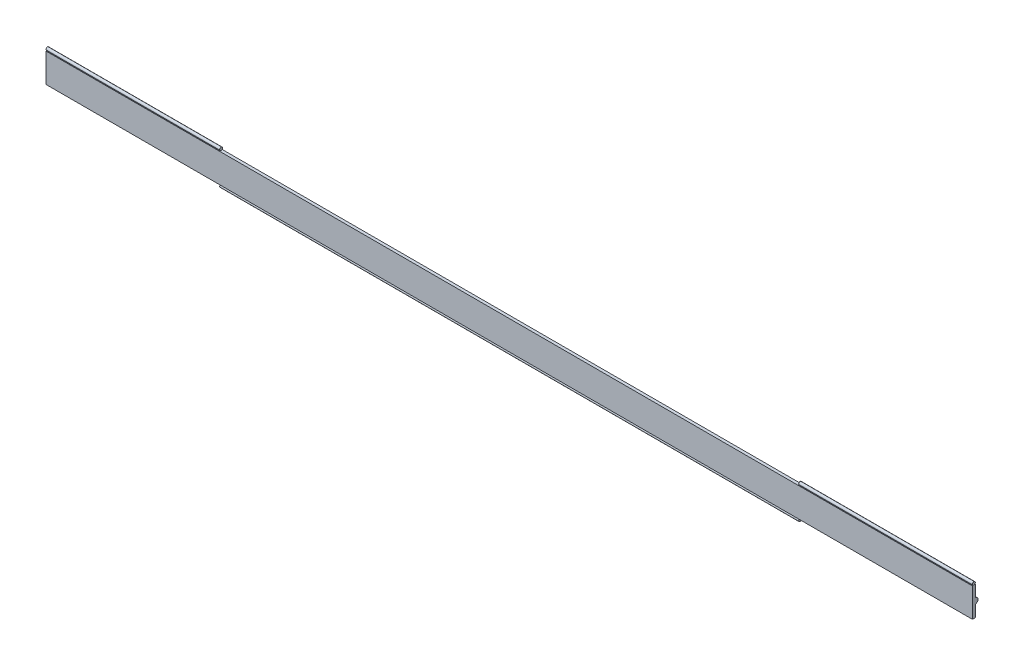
from build123d import *

# Parameters (mm, degrees)
SKETCH1_W               = 812.8
SKETCH1_H               = 25.4
BOSS_EXTRUDE1_DEPTH     = 2.54
SKETCH2_R               = 1.27
BOSS_EXTRUDE3_DEPTH     = 812.8
SKETCH3_R               = 1.27
BOSS_EXTRUDE4_DEPTH     = 812.8
CUT_EXTRUDE2_DEPTH      = 2.54
CUT_EXTRUDE2_DEPTH_BACK = 50.8
BOSS_EXTRUDE5_DEPTH     = 812.8


with BuildPart() as part:
    # Sketch1 → Boss-Extrude1 (new body)
    with BuildSketch(Plane.XY):
        with Locations((406.4, 12.7)):
            Rectangle(SKETCH1_W, SKETCH1_H)
    extrude(amount=BOSS_EXTRUDE1_DEPTH)

    # Sketch5 → Boss-Extrude5 (add)
    with BuildSketch(Plane(origin=(0, 0, 0), x_dir=(0, 0, -1), z_dir=(1, 0, 0))):
        with BuildLine():
            Line((0, 15.065771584), (0, 10.334228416))
            ThreePointArc((0, 10.334228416), (2.365771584, 12.7), (0, 15.065771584))
        make_face()
    extrude(amount=BOSS_EXTRUDE5_DEPTH)


with BuildPart() as body_2:
    # Sketch2 → Boss-Extrude3 (new body)
    with BuildSketch(Plane(origin=(812.8, 0, 0), x_dir=(0, 0, -1), z_dir=(1, 0, 0))):
        with Locations((-1.27, -1.27)):
            Circle(SKETCH2_R)
    extrude(amount=-BOSS_EXTRUDE3_DEPTH)


with BuildPart() as body_3:
    # Sketch3 → Boss-Extrude4 (new body)
    with BuildSketch(Plane(origin=(812.8, 0, 0), x_dir=(0, 0, -1), z_dir=(1, 0, 0))):
        with Locations((-1.27, 26.67)):
            Circle(SKETCH3_R)
    extrude(amount=-BOSS_EXTRUDE4_DEPTH)


with BuildPart() as cut_extrude2_tool:
    # Sketch4 → Cut-Extrude2 (new, two sides: drawn at the far end of the back side and taken through both)
    with BuildSketch(Plane.XY.offset(-CUT_EXTRUDE2_DEPTH_BACK)):
        Polygon((-59.58687438, 102.507346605), (-59.58687438, -50.8), (101.6, -50.8), (101.6, -69.183232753), (711.2, -69.183232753), (711.2, -50.8), (762, -50.8), (762, -69.183232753), (907.954503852, -69.183232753), (907.954503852, 95.270971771), (609.6, 95.270971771), (609.6, 76.2), (203.2, 76.2), (203.2, 102.507346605), (0, 102.507346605), align=None)
        Polygon((-8.78687438, 0), (152.4, 0), (152.4, -18.383232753), (660.4, -18.383232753), (660.4, 0), (812.8, 0), (812.8, -18.383232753), (857.154503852, -18.383232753), (857.154503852, 44.470971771), (660.4, 44.470971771), (660.4, 25.4), (152.4, 25.4), (152.4, 51.707346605), (0, 51.707346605), (-8.78687438, 51.707346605), align=None, mode=Mode.SUBTRACT)
    extrude(amount=CUT_EXTRUDE2_DEPTH + CUT_EXTRUDE2_DEPTH_BACK)


with BuildPart() as body_2_1:
    add(body_2.part)

    # Cut-Extrude2: cut by cut_extrude2_tool
    add(cut_extrude2_tool.part, mode=Mode.SUBTRACT)


with BuildPart() as body_3_1:
    add(body_3.part)

    # Cut-Extrude2: cut by cut_extrude2_tool
    add(cut_extrude2_tool.part, mode=Mode.SUBTRACT)


solid = Compound([part.part, body_2_1.part, body_3_1.part])
